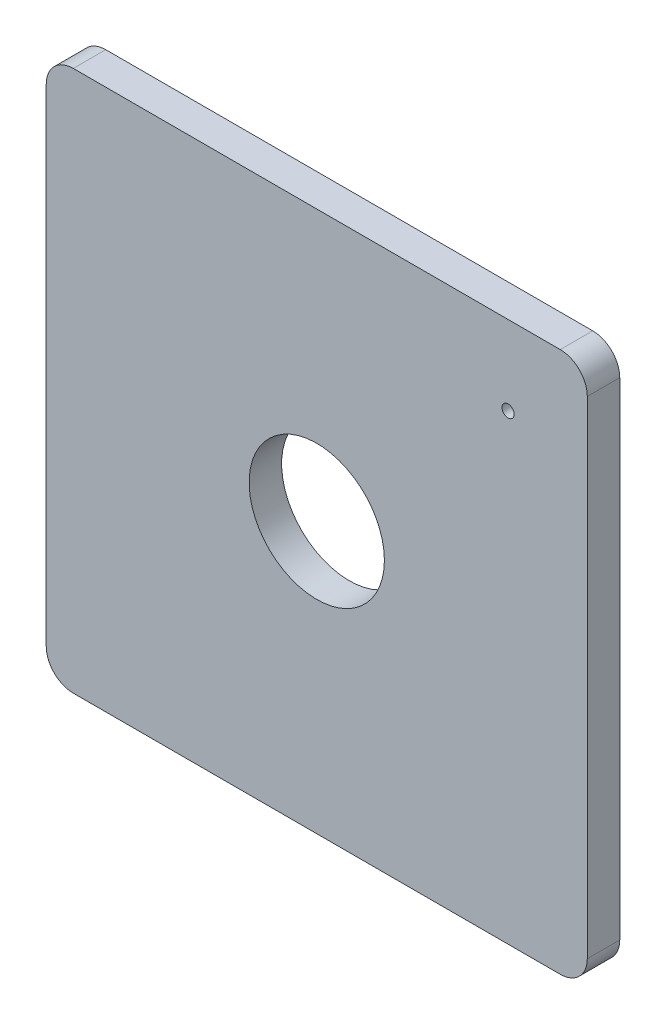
from build123d import *

# Parameters (mm, degrees)
ESQUISSE1_W             = 200
ESQUISSE1_H             = 200
ESQUISSE1_R             = 25
BOSS_EXTRU_1_DEPTH      = 12
ESQUISSE2_R             = 2.25
ENL_V_MAT_EXTRU_1_DEPTH = 284.097156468
CHANFREIN1_SIZE         = 4
CONG_2_R                = 10


with BuildPart() as part:
    # Esquisse1 → Boss.-Extru.1 (new body)
    with BuildSketch(Plane.XY):
        with Locations((100, -100)):
            Rectangle(ESQUISSE1_W, ESQUISSE1_H)
        with Locations((100, -100)):
            Circle(ESQUISSE1_R, mode=Mode.SUBTRACT)
    extrude(amount=BOSS_EXTRU_1_DEPTH)

    # Esquisse2 → Enl_v. mat.-Extru.1 (cut, through all)
    with BuildSketch(Plane.XY.offset(12)):
        with Locations((170.710678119, -29.289321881)):
            Circle(ESQUISSE2_R)
    extrude(amount=-ENL_V_MAT_EXTRU_1_DEPTH, mode=Mode.SUBTRACT)

    # Chanfrein1
    chanfrein1_edges = [part.edges().sort_by_distance(p)[0] for p in [
        (168.460678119, -29.289321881, 0),
    ]]
    chamfer(chanfrein1_edges, length=CHANFREIN1_SIZE)

    # Cong_2
    cong_2_edges = [part.edges().sort_by_distance(p)[0] for p in [
        (0, 0, 6),
        (200, 0, 6),
        (200, -200, 6),
        (0, -200, 6),
    ]]
    fillet(cong_2_edges, radius=CONG_2_R)


solid = part.part
